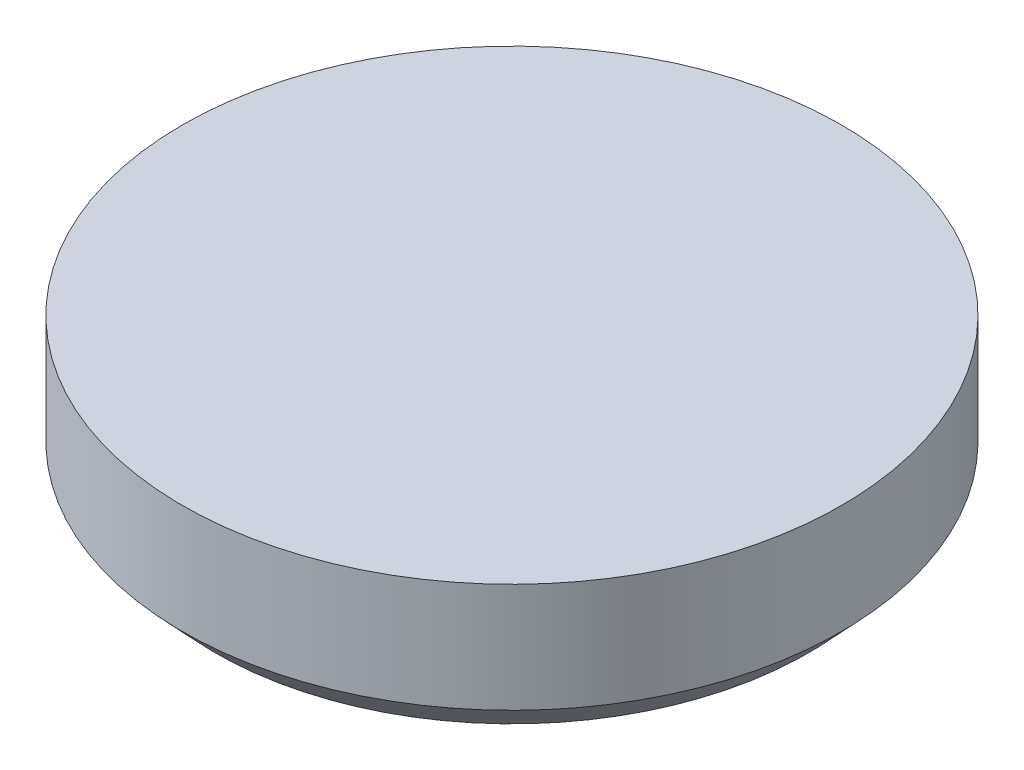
ISO-10303-21;
HEADER;
FILE_DESCRIPTION(('STEP AP214'),'2;1');
FILE_NAME('part.step','',(''),(''),'','','');
FILE_SCHEMA(('AUTOMOTIVE_DESIGN { 1 0 10303 214 1 1 1 1 }'));
ENDSEC;
DATA;
#1=APPLICATION_CONTEXT('core data for automotive mechanical design processes');
#2=APPLICATION_PROTOCOL_DEFINITION('international standard','automotive_design',2000,#1);
#3=PRODUCT_CONTEXT('',#1,'mechanical');
#4=PRODUCT('Part','Part','',(#3));
#5=PRODUCT_RELATED_PRODUCT_CATEGORY('part','',(#4));
#6=PRODUCT_DEFINITION_FORMATION('','',#4);
#7=PRODUCT_DEFINITION_CONTEXT('part definition',#1,'design');
#8=PRODUCT_DEFINITION('design','',#6,#7);
#9=PRODUCT_DEFINITION_SHAPE('','',#8);
#10=(LENGTH_UNIT() NAMED_UNIT(*) SI_UNIT(.MILLI.,.METRE.));
#11=(NAMED_UNIT(*) PLANE_ANGLE_UNIT() SI_UNIT($,.RADIAN.));
#12=(NAMED_UNIT(*) SI_UNIT($,.STERADIAN.) SOLID_ANGLE_UNIT());
#13=UNCERTAINTY_MEASURE_WITH_UNIT(LENGTH_MEASURE(1.E-05),#10,'distance_accuracy_value','');
#14=(GEOMETRIC_REPRESENTATION_CONTEXT(3) GLOBAL_UNCERTAINTY_ASSIGNED_CONTEXT((#13)) GLOBAL_UNIT_ASSIGNED_CONTEXT((#10,
#11,#12)) REPRESENTATION_CONTEXT('',''));
#15=CARTESIAN_POINT('',(0.,0.,0.));
#16=DIRECTION('',(0.,0.,1.));
#17=DIRECTION('',(1.,0.,0.));
#18=AXIS2_PLACEMENT_3D('',#15,#16,#17);
#19=CARTESIAN_POINT('',(0.,350.,0.));
#20=DIRECTION('',(0.,-1.,0.));
#21=DIRECTION('',(1.,0.,0.));
#22=AXIS2_PLACEMENT_3D('',#19,#20,#21);
#23=PLANE('',#22);
#24=CARTESIAN_POINT('',(0.,350.,0.));
#25=DIRECTION('',(0.,1.,0.));
#26=DIRECTION('',(-1.,0.,0.));
#27=AXIS2_PLACEMENT_3D('',#24,#25,#26);
#28=CIRCLE('',#27,800.);
#29=CARTESIAN_POINT('',(-800.,350.,0.));
#30=VERTEX_POINT('',#29);
#31=EDGE_CURVE('E10',#30,#30,#28,.T.);
#32=ORIENTED_EDGE('',*,*,#31,.T.);
#33=EDGE_LOOP('',(#32));
#34=FACE_BOUND('',#33,.T.);
#35=ADVANCED_FACE('F30',(#34),#23,.F.);
#36=CARTESIAN_POINT('',(0.,350.,0.));
#37=DIRECTION('',(0.,1.,0.));
#38=DIRECTION('',(-1.,0.,0.));
#39=AXIS2_PLACEMENT_3D('',#36,#37,#38);
#40=CYLINDRICAL_SURFACE('',#39,800.);
#41=ORIENTED_EDGE('',*,*,#31,.F.);
#42=EDGE_LOOP('',(#41));
#43=FACE_BOUND('',#42,.T.);
#44=CARTESIAN_POINT('',(0.,84.9999999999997,0.));
#45=DIRECTION('',(0.,1.,0.));
#46=DIRECTION('',(-1.,0.,0.));
#47=AXIS2_PLACEMENT_3D('',#44,#45,#46);
#48=CIRCLE('',#47,800.);
#49=CARTESIAN_POINT('',(-800.,84.9999999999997,0.));
#50=VERTEX_POINT('',#49);
#51=EDGE_CURVE('E36',#50,#50,#48,.T.);
#52=ORIENTED_EDGE('',*,*,#51,.T.);
#53=EDGE_LOOP('',(#52));
#54=FACE_BOUND('',#53,.T.);
#55=ADVANCED_FACE('F55',(#43,#54),#40,.T.);
#56=CARTESIAN_POINT('',(0.,0.,0.));
#57=DIRECTION('',(0.,1.,0.));
#58=DIRECTION('',(-1.,0.,0.));
#59=AXIS2_PLACEMENT_3D('',#56,#57,#58);
#60=CONICAL_SURFACE('',#59,720.,0.755104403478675);
#61=ORIENTED_EDGE('',*,*,#51,.F.);
#62=EDGE_LOOP('',(#61));
#63=FACE_BOUND('',#62,.T.);
#64=CARTESIAN_POINT('',(0.,0.,0.));
#65=DIRECTION('',(0.,1.,0.));
#66=DIRECTION('',(-1.,0.,0.));
#67=AXIS2_PLACEMENT_3D('',#64,#65,#66);
#68=CIRCLE('',#67,720.);
#69=CARTESIAN_POINT('',(-720.,0.,0.));
#70=VERTEX_POINT('',#69);
#71=EDGE_CURVE('E40',#70,#70,#68,.T.);
#72=ORIENTED_EDGE('',*,*,#71,.T.);
#73=EDGE_LOOP('',(#72));
#74=FACE_BOUND('',#73,.T.);
#75=ADVANCED_FACE('F47',(#63,#74),#60,.T.);
#76=CARTESIAN_POINT('',(720.,0.,1.67195757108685E-13));
#77=DIRECTION('',(0.,1.,0.));
#78=DIRECTION('',(-1.,0.,0.));
#79=AXIS2_PLACEMENT_3D('',#76,#77,#78);
#80=PLANE('',#79);
#81=ORIENTED_EDGE('',*,*,#71,.F.);
#82=EDGE_LOOP('',(#81));
#83=FACE_BOUND('',#82,.T.);
#84=ADVANCED_FACE('F49',(#83),#80,.F.);
#85=CLOSED_SHELL('',(#35,#55,#75,#84));
#86=MANIFOLD_SOLID_BREP('B2',#85);
#87=ADVANCED_BREP_SHAPE_REPRESENTATION('',(#18,#86),#14);
#88=SHAPE_DEFINITION_REPRESENTATION(#9,#87);
ENDSEC;
END-ISO-10303-21;
